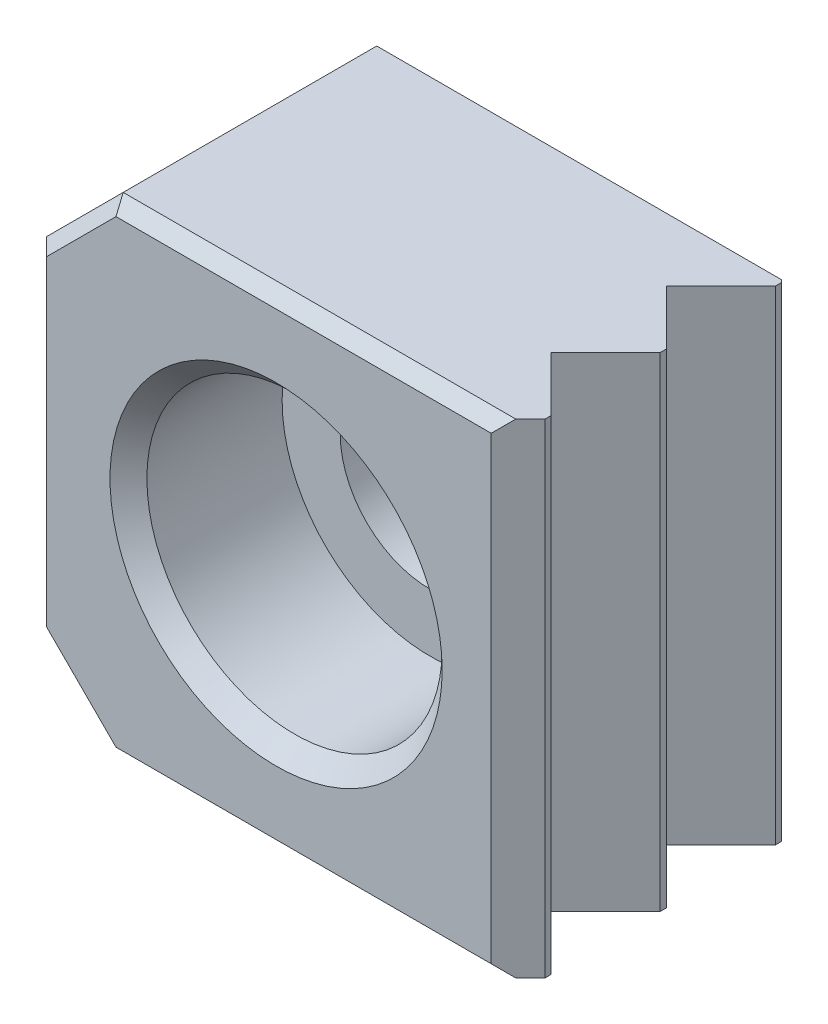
ISO-10303-21;
HEADER;
FILE_DESCRIPTION(('STEP AP214'),'2;1');
FILE_NAME('part.step','',(''),(''),'','','');
FILE_SCHEMA(('AUTOMOTIVE_DESIGN { 1 0 10303 214 1 1 1 1 }'));
ENDSEC;
DATA;
#1=APPLICATION_CONTEXT('core data for automotive mechanical design processes');
#2=APPLICATION_PROTOCOL_DEFINITION('international standard','automotive_design',2000,#1);
#3=PRODUCT_CONTEXT('',#1,'mechanical');
#4=PRODUCT('Part','Part','',(#3));
#5=PRODUCT_RELATED_PRODUCT_CATEGORY('part','',(#4));
#6=PRODUCT_DEFINITION_FORMATION('','',#4);
#7=PRODUCT_DEFINITION_CONTEXT('part definition',#1,'design');
#8=PRODUCT_DEFINITION('design','',#6,#7);
#9=PRODUCT_DEFINITION_SHAPE('','',#8);
#10=(LENGTH_UNIT() NAMED_UNIT(*) SI_UNIT(.MILLI.,.METRE.));
#11=(NAMED_UNIT(*) PLANE_ANGLE_UNIT() SI_UNIT($,.RADIAN.));
#12=(NAMED_UNIT(*) SI_UNIT($,.STERADIAN.) SOLID_ANGLE_UNIT());
#13=UNCERTAINTY_MEASURE_WITH_UNIT(LENGTH_MEASURE(1.E-05),#10,'distance_accuracy_value','');
#14=(GEOMETRIC_REPRESENTATION_CONTEXT(3) GLOBAL_UNCERTAINTY_ASSIGNED_CONTEXT((#13)) GLOBAL_UNIT_ASSIGNED_CONTEXT((#10,
#11,#12)) REPRESENTATION_CONTEXT('',''));
#15=CARTESIAN_POINT('',(0.,0.,0.));
#16=DIRECTION('',(0.,0.,1.));
#17=DIRECTION('',(1.,0.,0.));
#18=AXIS2_PLACEMENT_3D('',#15,#16,#17);
#19=CARTESIAN_POINT('',(5.,-5.,6.));
#20=DIRECTION('',(-1.,0.,0.));
#21=DIRECTION('',(0.,-1.,0.));
#22=AXIS2_PLACEMENT_3D('',#19,#20,#21);
#23=PLANE('',#22);
#24=DIRECTION('',(0.,1.,0.));
#25=VECTOR('',#24,1.);
#26=CARTESIAN_POINT('',(5.,-5.,3.0635000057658));
#27=LINE('',#26,#25);
#28=CARTESIAN_POINT('',(5.,-5.,3.0635000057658));
#29=VERTEX_POINT('',#28);
#30=CARTESIAN_POINT('',(5.,5.,3.0635000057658));
#31=VERTEX_POINT('',#30);
#32=EDGE_CURVE('E221',#29,#31,#27,.T.);
#33=ORIENTED_EDGE('',*,*,#32,.F.);
#34=DIRECTION('',(0.,0.,-1.));
#35=VECTOR('',#34,1.);
#36=CARTESIAN_POINT('',(5.,-5.,6.));
#37=LINE('',#36,#35);
#38=CARTESIAN_POINT('',(5.,-5.,2.9364999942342));
#39=VERTEX_POINT('',#38);
#40=EDGE_CURVE('E177',#29,#39,#37,.T.);
#41=ORIENTED_EDGE('',*,*,#40,.T.);
#42=DIRECTION('',(0.,1.,0.));
#43=VECTOR('',#42,1.);
#44=CARTESIAN_POINT('',(5.,-5.,2.9364999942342));
#45=LINE('',#44,#43);
#46=CARTESIAN_POINT('',(5.,5.,2.9364999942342));
#47=VERTEX_POINT('',#46);
#48=EDGE_CURVE('E214',#39,#47,#45,.T.);
#49=ORIENTED_EDGE('',*,*,#48,.T.);
#50=DIRECTION('',(0.,0.,-1.));
#51=VECTOR('',#50,1.);
#52=CARTESIAN_POINT('',(5.,5.,6.));
#53=LINE('',#52,#51);
#54=EDGE_CURVE('E236',#31,#47,#53,.T.);
#55=ORIENTED_EDGE('',*,*,#54,.F.);
#56=EDGE_LOOP('',(#33,#41,#49,#55));
#57=FACE_BOUND('',#56,.T.);
#58=ADVANCED_FACE('F14',(#57),#23,.F.);
#59=DIRECTION('',(0.,-1.,0.));
#60=VECTOR('',#59,1.);
#61=CARTESIAN_POINT('',(5.,-5.,5.3177500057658));
#62=LINE('',#61,#60);
#63=CARTESIAN_POINT('',(5.,5.,5.3177500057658));
#64=VERTEX_POINT('',#63);
#65=CARTESIAN_POINT('',(5.,-5.,5.3177500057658));
#66=VERTEX_POINT('',#65);
#67=EDGE_CURVE('E156',#64,#66,#62,.T.);
#68=ORIENTED_EDGE('',*,*,#67,.F.);
#69=CARTESIAN_POINT('',(5.,5.,5.4447500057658));
#70=VERTEX_POINT('',#69);
#71=EDGE_CURVE('E237',#70,#64,#53,.T.);
#72=ORIENTED_EDGE('',*,*,#71,.F.);
#73=DIRECTION('',(0.,1.,0.));
#74=VECTOR('',#73,1.);
#75=CARTESIAN_POINT('',(5.,-5.,5.4447500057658));
#76=LINE('',#75,#74);
#77=CARTESIAN_POINT('',(5.,-5.,5.4447500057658));
#78=VERTEX_POINT('',#77);
#79=EDGE_CURVE('E212',#78,#70,#76,.T.);
#80=ORIENTED_EDGE('',*,*,#79,.F.);
#81=EDGE_CURVE('E232',#78,#66,#37,.T.);
#82=ORIENTED_EDGE('',*,*,#81,.T.);
#83=EDGE_LOOP('',(#68,#72,#80,#82));
#84=FACE_BOUND('',#83,.T.);
#85=ADVANCED_FACE('F393',(#84),#23,.F.);
#86=CARTESIAN_POINT('',(5.,-5.,0.682249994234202));
#87=VERTEX_POINT('',#86);
#88=CARTESIAN_POINT('',(5.,-5.,0.555249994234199));
#89=VERTEX_POINT('',#88);
#90=EDGE_CURVE('E229',#87,#89,#37,.T.);
#91=ORIENTED_EDGE('',*,*,#90,.T.);
#92=DIRECTION('',(0.,1.,0.));
#93=VECTOR('',#92,1.);
#94=CARTESIAN_POINT('',(5.,-5.,0.555249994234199));
#95=LINE('',#94,#93);
#96=CARTESIAN_POINT('',(5.,5.,0.5552499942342));
#97=VERTEX_POINT('',#96);
#98=EDGE_CURVE('E169',#89,#97,#95,.T.);
#99=ORIENTED_EDGE('',*,*,#98,.T.);
#100=CARTESIAN_POINT('',(5.,5.,0.682249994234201));
#101=VERTEX_POINT('',#100);
#102=EDGE_CURVE('E233',#101,#97,#53,.T.);
#103=ORIENTED_EDGE('',*,*,#102,.F.);
#104=DIRECTION('',(0.,-1.,0.));
#105=VECTOR('',#104,1.);
#106=CARTESIAN_POINT('',(5.,-5.,0.682249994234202));
#107=LINE('',#106,#105);
#108=EDGE_CURVE('E217',#101,#87,#107,.T.);
#109=ORIENTED_EDGE('',*,*,#108,.T.);
#110=EDGE_LOOP('',(#91,#99,#103,#109));
#111=FACE_BOUND('',#110,.T.);
#112=ADVANCED_FACE('F368',(#111),#23,.F.);
#113=CARTESIAN_POINT('',(-5.,5.,6.));
#114=DIRECTION('',(0.,1.,0.));
#115=DIRECTION('',(-1.,0.,0.));
#116=AXIS2_PLACEMENT_3D('',#113,#114,#115);
#117=PLANE('',#116);
#118=DIRECTION('',(0.,0.,1.));
#119=VECTOR('',#118,1.);
#120=CARTESIAN_POINT('',(-3.4125,5.,6.));
#121=LINE('',#120,#119);
#122=CARTESIAN_POINT('',(-3.4125,5.,0.508));
#123=VERTEX_POINT('',#122);
#124=CARTESIAN_POINT('',(-3.4125,5.,5.746));
#125=VERTEX_POINT('',#124);
#126=EDGE_CURVE('E250',#123,#125,#121,.T.);
#127=ORIENTED_EDGE('',*,*,#126,.T.);
#128=DIRECTION('',(1.,0.,0.));
#129=VECTOR('',#128,1.);
#130=CARTESIAN_POINT('',(4.44475005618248,5.,5.746));
#131=LINE('',#130,#129);
#132=CARTESIAN_POINT('',(4.6987500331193,5.,5.746));
#133=VERTEX_POINT('',#132);
#134=EDGE_CURVE('E9',#125,#133,#131,.T.);
#135=ORIENTED_EDGE('',*,*,#134,.T.);
#136=DIRECTION('',(-0.707106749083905,0.,0.707106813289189));
#137=VECTOR('',#136,1.);
#138=CARTESIAN_POINT('',(5.0635,5.,5.38125));
#139=LINE('',#138,#137);
#140=EDGE_CURVE('E196',#70,#133,#139,.T.);
#141=ORIENTED_EDGE('',*,*,#140,.F.);
#142=ORIENTED_EDGE('',*,*,#71,.T.);
#143=DIRECTION('',(0.70710681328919,0.,0.707106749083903));
#144=VECTOR('',#143,1.);
#145=CARTESIAN_POINT('',(3.872875,5.,4.19062510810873));
#146=LINE('',#145,#144);
#147=CARTESIAN_POINT('',(3.872875,5.,4.19062510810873));
#148=VERTEX_POINT('',#147);
#149=EDGE_CURVE('E194',#148,#64,#146,.T.);
#150=ORIENTED_EDGE('',*,*,#149,.F.);
#151=DIRECTION('',(-0.707106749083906,0.,0.707106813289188));
#152=VECTOR('',#151,1.);
#153=CARTESIAN_POINT('',(5.0635,5.,3.));
#154=LINE('',#153,#152);
#155=EDGE_CURVE('E168',#31,#148,#154,.T.);
#156=ORIENTED_EDGE('',*,*,#155,.F.);
#157=ORIENTED_EDGE('',*,*,#54,.T.);
#158=DIRECTION('',(-0.707106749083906,0.,-0.707106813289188));
#159=VECTOR('',#158,1.);
#160=CARTESIAN_POINT('',(5.0635,5.,3.));
#161=LINE('',#160,#159);
#162=CARTESIAN_POINT('',(3.872875,5.,1.80937489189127));
#163=VERTEX_POINT('',#162);
#164=EDGE_CURVE('E205',#47,#163,#161,.T.);
#165=ORIENTED_EDGE('',*,*,#164,.T.);
#166=DIRECTION('',(0.707106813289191,0.,-0.707106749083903));
#167=VECTOR('',#166,1.);
#168=CARTESIAN_POINT('',(3.872875,5.,1.80937489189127));
#169=LINE('',#168,#167);
#170=EDGE_CURVE('E202',#163,#101,#169,.T.);
#171=ORIENTED_EDGE('',*,*,#170,.T.);
#172=ORIENTED_EDGE('',*,*,#102,.T.);
#173=DIRECTION('',(-0.707106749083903,0.,-0.70710681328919));
#174=VECTOR('',#173,1.);
#175=CARTESIAN_POINT('',(5.0635,5.,0.61875));
#176=LINE('',#175,#174);
#177=CARTESIAN_POINT('',(4.9527500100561,5.,0.508));
#178=VERTEX_POINT('',#177);
#179=EDGE_CURVE('E199',#97,#178,#176,.T.);
#180=ORIENTED_EDGE('',*,*,#179,.T.);
#181=DIRECTION('',(-1.,0.,0.));
#182=VECTOR('',#181,1.);
#183=CARTESIAN_POINT('',(-5.,5.,0.508));
#184=LINE('',#183,#182);
#185=EDGE_CURVE('E289',#178,#123,#184,.T.);
#186=ORIENTED_EDGE('',*,*,#185,.T.);
#187=EDGE_LOOP('',(#127,#135,#141,#142,#150,#156,#157,#165,#171,#172,#180,#186));
#188=FACE_BOUND('',#187,.T.);
#189=ADVANCED_FACE('F364',(#188),#117,.T.);
#190=CARTESIAN_POINT('',(5.,-5.,6.));
#191=DIRECTION('',(0.,-1.,0.));
#192=DIRECTION('',(1.,0.,0.));
#193=AXIS2_PLACEMENT_3D('',#190,#191,#192);
#194=PLANE('',#193);
#195=DIRECTION('',(-0.707106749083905,0.,0.707106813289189));
#196=VECTOR('',#195,1.);
#197=CARTESIAN_POINT('',(5.0635,-5.,5.38125));
#198=LINE('',#197,#196);
#199=CARTESIAN_POINT('',(4.6987500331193,-5.,5.746));
#200=VERTEX_POINT('',#199);
#201=EDGE_CURVE('E161',#78,#200,#198,.T.);
#202=ORIENTED_EDGE('',*,*,#201,.T.);
#203=DIRECTION('',(-1.,0.,0.));
#204=VECTOR('',#203,1.);
#205=CARTESIAN_POINT('',(-3.4125,-5.,5.746));
#206=LINE('',#205,#204);
#207=CARTESIAN_POINT('',(-3.4125,-5.,5.746));
#208=VERTEX_POINT('',#207);
#209=EDGE_CURVE('E291',#200,#208,#206,.T.);
#210=ORIENTED_EDGE('',*,*,#209,.T.);
#211=DIRECTION('',(0.,0.,-1.));
#212=VECTOR('',#211,1.);
#213=CARTESIAN_POINT('',(-3.4125,-5.,0.));
#214=LINE('',#213,#212);
#215=CARTESIAN_POINT('',(-3.4125,-5.,0.508));
#216=VERTEX_POINT('',#215);
#217=EDGE_CURVE('E244',#208,#216,#214,.T.);
#218=ORIENTED_EDGE('',*,*,#217,.T.);
#219=DIRECTION('',(1.,0.,0.));
#220=VECTOR('',#219,1.);
#221=CARTESIAN_POINT('',(5.,-5.,0.508));
#222=LINE('',#221,#220);
#223=CARTESIAN_POINT('',(4.9527500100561,-5.,0.508));
#224=VERTEX_POINT('',#223);
#225=EDGE_CURVE('E275',#216,#224,#222,.T.);
#226=ORIENTED_EDGE('',*,*,#225,.T.);
#227=DIRECTION('',(-0.707106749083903,0.,-0.70710681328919));
#228=VECTOR('',#227,1.);
#229=CARTESIAN_POINT('',(5.0635,-5.,0.61875));
#230=LINE('',#229,#228);
#231=EDGE_CURVE('E186',#89,#224,#230,.T.);
#232=ORIENTED_EDGE('',*,*,#231,.F.);
#233=ORIENTED_EDGE('',*,*,#90,.F.);
#234=DIRECTION('',(0.707106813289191,0.,-0.707106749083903));
#235=VECTOR('',#234,1.);
#236=CARTESIAN_POINT('',(3.872875,-5.,1.80937489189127));
#237=LINE('',#236,#235);
#238=CARTESIAN_POINT('',(3.872875,-5.,1.80937489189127));
#239=VERTEX_POINT('',#238);
#240=EDGE_CURVE('E189',#239,#87,#237,.T.);
#241=ORIENTED_EDGE('',*,*,#240,.F.);
#242=DIRECTION('',(-0.707106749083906,0.,-0.707106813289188));
#243=VECTOR('',#242,1.);
#244=CARTESIAN_POINT('',(5.0635,-5.,3.));
#245=LINE('',#244,#243);
#246=EDGE_CURVE('E191',#39,#239,#245,.T.);
#247=ORIENTED_EDGE('',*,*,#246,.F.);
#248=ORIENTED_EDGE('',*,*,#40,.F.);
#249=DIRECTION('',(-0.707106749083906,0.,0.707106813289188));
#250=VECTOR('',#249,1.);
#251=CARTESIAN_POINT('',(5.0635,-5.,3.));
#252=LINE('',#251,#250);
#253=CARTESIAN_POINT('',(3.872875,-5.,4.19062510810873));
#254=VERTEX_POINT('',#253);
#255=EDGE_CURVE('E162',#29,#254,#252,.T.);
#256=ORIENTED_EDGE('',*,*,#255,.T.);
#257=DIRECTION('',(0.70710681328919,0.,0.707106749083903));
#258=VECTOR('',#257,1.);
#259=CARTESIAN_POINT('',(3.872875,-5.,4.19062510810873));
#260=LINE('',#259,#258);
#261=EDGE_CURVE('E150',#254,#66,#260,.T.);
#262=ORIENTED_EDGE('',*,*,#261,.T.);
#263=ORIENTED_EDGE('',*,*,#81,.F.);
#264=EDGE_LOOP('',(#202,#210,#218,#226,#232,#233,#241,#247,#248,#256,#262,#263));
#265=FACE_BOUND('',#264,.T.);
#266=ADVANCED_FACE('F174',(#265),#194,.T.);
#267=CARTESIAN_POINT('',(5.,5.,6.));
#268=DIRECTION('',(0.,0.,-1.));
#269=DIRECTION('',(1.,0.,0.));
#270=AXIS2_PLACEMENT_3D('',#267,#268,#269);
#271=PLANE('',#270);
#272=CARTESIAN_POINT('',(0.,0.,6.));
#273=DIRECTION('',(0.,0.,-1.));
#274=DIRECTION('',(1.,0.,0.));
#275=AXIS2_PLACEMENT_3D('',#272,#273,#274);
#276=CIRCLE('',#275,3.431);
#277=CARTESIAN_POINT('',(3.431,0.,6.));
#278=VERTEX_POINT('',#277);
#279=EDGE_CURVE('E255',#278,#278,#276,.T.);
#280=ORIENTED_EDGE('',*,*,#279,.T.);
#281=EDGE_LOOP('',(#280));
#282=FACE_BOUND('',#281,.T.);
#283=DIRECTION('',(0.707106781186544,-0.707106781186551,0.));
#284=VECTOR('',#283,1.);
#285=CARTESIAN_POINT('',(-3.2328948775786,-4.82039487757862,6.));
#286=LINE('',#285,#284);
#287=CARTESIAN_POINT('',(-4.746,-3.30728975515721,6.));
#288=VERTEX_POINT('',#287);
#289=CARTESIAN_POINT('',(-3.30728975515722,-4.746,6.));
#290=VERTEX_POINT('',#289);
#291=EDGE_CURVE('E300',#288,#290,#286,.T.);
#292=ORIENTED_EDGE('',*,*,#291,.T.);
#293=DIRECTION('',(1.,0.,0.));
#294=VECTOR('',#293,1.);
#295=CARTESIAN_POINT('',(4.44475005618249,-4.746,6.));
#296=LINE('',#295,#294);
#297=CARTESIAN_POINT('',(4.44475005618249,-4.746,6.));
#298=VERTEX_POINT('',#297);
#299=EDGE_CURVE('E302',#290,#298,#296,.T.);
#300=ORIENTED_EDGE('',*,*,#299,.T.);
#301=DIRECTION('',(0.,-1.,0.));
#302=VECTOR('',#301,1.);
#303=CARTESIAN_POINT('',(4.44475005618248,5.,6.));
#304=LINE('',#303,#302);
#305=CARTESIAN_POINT('',(4.44475005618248,4.746,6.));
#306=VERTEX_POINT('',#305);
#307=EDGE_CURVE('E241',#306,#298,#304,.T.);
#308=ORIENTED_EDGE('',*,*,#307,.F.);
#309=DIRECTION('',(-1.,0.,0.));
#310=VECTOR('',#309,1.);
#311=CARTESIAN_POINT('',(-3.4125,4.746,6.));
#312=LINE('',#311,#310);
#313=CARTESIAN_POINT('',(-3.30728975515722,4.746,6.));
#314=VERTEX_POINT('',#313);
#315=EDGE_CURVE('E294',#306,#314,#312,.T.);
#316=ORIENTED_EDGE('',*,*,#315,.T.);
#317=DIRECTION('',(-0.707106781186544,-0.707106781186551,0.));
#318=VECTOR('',#317,1.);
#319=CARTESIAN_POINT('',(-4.82039487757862,3.23289487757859,6.));
#320=LINE('',#319,#318);
#321=CARTESIAN_POINT('',(-4.746,3.30728975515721,6.));
#322=VERTEX_POINT('',#321);
#323=EDGE_CURVE('E296',#314,#322,#320,.T.);
#324=ORIENTED_EDGE('',*,*,#323,.T.);
#325=DIRECTION('',(0.,-1.,0.));
#326=VECTOR('',#325,1.);
#327=CARTESIAN_POINT('',(-4.746,5.,6.));
#328=LINE('',#327,#326);
#329=EDGE_CURVE('E298',#322,#288,#328,.T.);
#330=ORIENTED_EDGE('',*,*,#329,.T.);
#331=EDGE_LOOP('',(#292,#300,#308,#316,#324,#330));
#332=FACE_BOUND('',#331,.T.);
#333=ADVANCED_FACE('F406',(#282,#332),#271,.F.);
#334=CARTESIAN_POINT('',(-5.,5.,6.));
#335=DIRECTION('',(1.,0.,0.));
#336=DIRECTION('',(0.,1.,0.));
#337=AXIS2_PLACEMENT_3D('',#334,#335,#336);
#338=PLANE('',#337);
#339=DIRECTION('',(0.,0.,1.));
#340=VECTOR('',#339,1.);
#341=CARTESIAN_POINT('',(-5.,-3.4125,6.));
#342=LINE('',#341,#340);
#343=CARTESIAN_POINT('',(-5.,-3.4125,0.508));
#344=VERTEX_POINT('',#343);
#345=CARTESIAN_POINT('',(-5.,-3.4125,5.746));
#346=VERTEX_POINT('',#345);
#347=EDGE_CURVE('E248',#344,#346,#342,.T.);
#348=ORIENTED_EDGE('',*,*,#347,.T.);
#349=DIRECTION('',(0.,1.,0.));
#350=VECTOR('',#349,1.);
#351=CARTESIAN_POINT('',(-5.,5.,5.746));
#352=LINE('',#351,#350);
#353=CARTESIAN_POINT('',(-5.,3.4125,5.746));
#354=VERTEX_POINT('',#353);
#355=EDGE_CURVE('E35',#346,#354,#352,.T.);
#356=ORIENTED_EDGE('',*,*,#355,.T.);
#357=DIRECTION('',(0.,0.,-1.));
#358=VECTOR('',#357,1.);
#359=CARTESIAN_POINT('',(-5.,3.4125,0.));
#360=LINE('',#359,#358);
#361=CARTESIAN_POINT('',(-5.,3.4125,0.508));
#362=VERTEX_POINT('',#361);
#363=EDGE_CURVE('E246',#354,#362,#360,.T.);
#364=ORIENTED_EDGE('',*,*,#363,.T.);
#365=DIRECTION('',(0.,-1.,0.));
#366=VECTOR('',#365,1.);
#367=CARTESIAN_POINT('',(-5.,-3.4125,0.508));
#368=LINE('',#367,#366);
#369=EDGE_CURVE('E284',#362,#344,#368,.T.);
#370=ORIENTED_EDGE('',*,*,#369,.T.);
#371=EDGE_LOOP('',(#348,#356,#364,#370));
#372=FACE_BOUND('',#371,.T.);
#373=ADVANCED_FACE('F319',(#372),#338,.F.);
#374=CARTESIAN_POINT('',(5.,5.,0.));
#375=DIRECTION('',(0.,0.,-1.));
#376=DIRECTION('',(1.,0.,0.));
#377=AXIS2_PLACEMENT_3D('',#374,#375,#376);
#378=PLANE('',#377);
#379=CARTESIAN_POINT('',(0.,0.,0.));
#380=DIRECTION('',(0.,0.,-1.));
#381=DIRECTION('',(1.,0.,0.));
#382=AXIS2_PLACEMENT_3D('',#379,#380,#381);
#383=CIRCLE('',#382,2.231);
#384=CARTESIAN_POINT('',(2.231,0.,0.));
#385=VERTEX_POINT('',#384);
#386=EDGE_CURVE('E258',#385,#385,#383,.F.);
#387=ORIENTED_EDGE('',*,*,#386,.T.);
#388=EDGE_LOOP('',(#387));
#389=FACE_BOUND('',#388,.T.);
#390=DIRECTION('',(0.,1.,0.));
#391=VECTOR('',#390,1.);
#392=CARTESIAN_POINT('',(4.44475005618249,5.,0.));
#393=LINE('',#392,#391);
#394=CARTESIAN_POINT('',(4.44475005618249,-4.492,0.));
#395=VERTEX_POINT('',#394);
#396=CARTESIAN_POINT('',(4.44475005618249,4.492,0.));
#397=VERTEX_POINT('',#396);
#398=EDGE_CURVE('E238',#395,#397,#393,.T.);
#399=ORIENTED_EDGE('',*,*,#398,.F.);
#400=DIRECTION('',(-1.,0.,0.));
#401=VECTOR('',#400,1.);
#402=CARTESIAN_POINT('',(5.,-4.492,0.));
#403=LINE('',#402,#401);
#404=CARTESIAN_POINT('',(-3.20207951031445,-4.492,0.));
#405=VERTEX_POINT('',#404);
#406=EDGE_CURVE('E272',#395,#405,#403,.T.);
#407=ORIENTED_EDGE('',*,*,#406,.T.);
#408=DIRECTION('',(-0.707106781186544,0.707106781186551,0.));
#409=VECTOR('',#408,1.);
#410=CARTESIAN_POINT('',(-3.84703975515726,-3.84703975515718,0.));
#411=LINE('',#410,#409);
#412=CARTESIAN_POINT('',(-4.492,-3.20207951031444,0.));
#413=VERTEX_POINT('',#412);
#414=EDGE_CURVE('E270',#405,#413,#411,.T.);
#415=ORIENTED_EDGE('',*,*,#414,.T.);
#416=DIRECTION('',(0.,1.,0.));
#417=VECTOR('',#416,1.);
#418=CARTESIAN_POINT('',(-4.492,3.4125,0.));
#419=LINE('',#418,#417);
#420=CARTESIAN_POINT('',(-4.492,3.20207951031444,0.));
#421=VERTEX_POINT('',#420);
#422=EDGE_CURVE('E268',#413,#421,#419,.T.);
#423=ORIENTED_EDGE('',*,*,#422,.T.);
#424=DIRECTION('',(0.707106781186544,0.707106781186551,0.));
#425=VECTOR('',#424,1.);
#426=CARTESIAN_POINT('',(1.15296024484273,8.84703975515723,0.));
#427=LINE('',#426,#425);
#428=CARTESIAN_POINT('',(-3.20207951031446,4.492,0.));
#429=VERTEX_POINT('',#428);
#430=EDGE_CURVE('E266',#421,#429,#427,.T.);
#431=ORIENTED_EDGE('',*,*,#430,.T.);
#432=DIRECTION('',(1.,0.,0.));
#433=VECTOR('',#432,1.);
#434=CARTESIAN_POINT('',(5.,4.492,0.));
#435=LINE('',#434,#433);
#436=EDGE_CURVE('E264',#429,#397,#435,.T.);
#437=ORIENTED_EDGE('',*,*,#436,.T.);
#438=EDGE_LOOP('',(#399,#407,#415,#423,#431,#437));
#439=FACE_BOUND('',#438,.T.);
#440=ADVANCED_FACE('F356',(#389,#439),#378,.T.);
#441=CARTESIAN_POINT('',(0.,0.,2.825));
#442=DIRECTION('',(0.,0.,1.));
#443=DIRECTION('',(-1.,0.,0.));
#444=AXIS2_PLACEMENT_3D('',#441,#442,#443);
#445=CYLINDRICAL_SURFACE('',#444,3.05);
#446=CARTESIAN_POINT('',(0.,0.,5.619));
#447=DIRECTION('',(0.,0.,-1.));
#448=DIRECTION('',(1.,0.,0.));
#449=AXIS2_PLACEMENT_3D('',#446,#447,#448);
#450=CIRCLE('',#449,3.05);
#451=CARTESIAN_POINT('',(3.05,0.,5.619));
#452=VERTEX_POINT('',#451);
#453=EDGE_CURVE('E252',#452,#452,#450,.F.);
#454=ORIENTED_EDGE('',*,*,#453,.T.);
#455=EDGE_LOOP('',(#454));
#456=FACE_BOUND('',#455,.T.);
#457=CARTESIAN_POINT('',(0.,0.,2.825));
#458=DIRECTION('',(0.,0.,1.));
#459=DIRECTION('',(-1.,0.,0.));
#460=AXIS2_PLACEMENT_3D('',#457,#458,#459);
#461=CIRCLE('',#460,3.05);
#462=CARTESIAN_POINT('',(-3.05,0.,2.825));
#463=VERTEX_POINT('',#462);
#464=EDGE_CURVE('E226',#463,#463,#461,.T.);
#465=ORIENTED_EDGE('',*,*,#464,.F.);
#466=EDGE_LOOP('',(#465));
#467=FACE_BOUND('',#466,.T.);
#468=ADVANCED_FACE('F416',(#456,#467),#445,.F.);
#469=CARTESIAN_POINT('',(0.,0.,2.825));
#470=DIRECTION('',(0.,0.,1.));
#471=DIRECTION('',(-1.,0.,0.));
#472=AXIS2_PLACEMENT_3D('',#469,#470,#471);
#473=PLANE('',#472);
#474=CARTESIAN_POINT('',(0.,0.,2.825));
#475=DIRECTION('',(0.,0.,1.));
#476=DIRECTION('',(-1.,0.,0.));
#477=AXIS2_PLACEMENT_3D('',#474,#475,#476);
#478=CIRCLE('',#477,1.85);
#479=CARTESIAN_POINT('',(-1.85,0.,2.825));
#480=VERTEX_POINT('',#479);
#481=EDGE_CURVE('E223',#480,#480,#478,.T.);
#482=ORIENTED_EDGE('',*,*,#481,.F.);
#483=EDGE_LOOP('',(#482));
#484=FACE_BOUND('',#483,.T.);
#485=ORIENTED_EDGE('',*,*,#464,.T.);
#486=EDGE_LOOP('',(#485));
#487=FACE_BOUND('',#486,.T.);
#488=ADVANCED_FACE('F420',(#484,#487),#473,.T.);
#489=CARTESIAN_POINT('',(0.,0.,0.));
#490=DIRECTION('',(0.,0.,1.));
#491=DIRECTION('',(-1.,0.,0.));
#492=AXIS2_PLACEMENT_3D('',#489,#490,#491);
#493=CYLINDRICAL_SURFACE('',#492,1.85);
#494=CARTESIAN_POINT('',(0.,0.,0.381));
#495=DIRECTION('',(0.,0.,-1.));
#496=DIRECTION('',(1.,0.,0.));
#497=AXIS2_PLACEMENT_3D('',#494,#495,#496);
#498=CIRCLE('',#497,1.85);
#499=CARTESIAN_POINT('',(1.85,0.,0.381));
#500=VERTEX_POINT('',#499);
#501=EDGE_CURVE('E261',#500,#500,#498,.T.);
#502=ORIENTED_EDGE('',*,*,#501,.T.);
#503=EDGE_LOOP('',(#502));
#504=FACE_BOUND('',#503,.T.);
#505=ORIENTED_EDGE('',*,*,#481,.T.);
#506=EDGE_LOOP('',(#505));
#507=FACE_BOUND('',#506,.T.);
#508=ADVANCED_FACE('F424',(#504,#507),#493,.F.);
#509=CARTESIAN_POINT('',(5.0635,5.,0.61875));
#510=DIRECTION('',(-0.707106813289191,0.,0.707106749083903));
#511=DIRECTION('',(-0.707106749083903,0.,-0.707106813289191));
#512=AXIS2_PLACEMENT_3D('',#509,#510,#511);
#513=PLANE('',#512);
#514=ORIENTED_EDGE('',*,*,#231,.T.);
#515=DIRECTION('',(0.577350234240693,-0.577350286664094,0.577350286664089));
#516=VECTOR('',#515,1.);
#517=CARTESIAN_POINT('',(4.62983334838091,-4.67708330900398,0.185083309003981));
#518=LINE('',#517,#516);
#519=EDGE_CURVE('E279',#224,#395,#518,.F.);
#520=ORIENTED_EDGE('',*,*,#519,.T.);
#521=ORIENTED_EDGE('',*,*,#398,.T.);
#522=DIRECTION('',(-0.577350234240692,-0.577350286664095,-0.577350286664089));
#523=VECTOR('',#522,1.);
#524=CARTESIAN_POINT('',(4.62983334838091,4.67708330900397,0.185083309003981));
#525=LINE('',#524,#523);
#526=EDGE_CURVE('E277',#397,#178,#525,.F.);
#527=ORIENTED_EDGE('',*,*,#526,.T.);
#528=ORIENTED_EDGE('',*,*,#179,.F.);
#529=ORIENTED_EDGE('',*,*,#98,.F.);
#530=EDGE_LOOP('',(#514,#520,#521,#527,#528,#529));
#531=FACE_BOUND('',#530,.T.);
#532=ADVANCED_FACE('F362',(#531),#513,.F.);
#533=CARTESIAN_POINT('',(5.0635,5.,5.38125));
#534=DIRECTION('',(0.707106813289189,0.,0.707106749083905));
#535=DIRECTION('',(-0.707106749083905,0.,0.707106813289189));
#536=AXIS2_PLACEMENT_3D('',#533,#534,#535);
#537=PLANE('',#536);
#538=ORIENTED_EDGE('',*,*,#307,.T.);
#539=DIRECTION('',(0.577350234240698,-0.577350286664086,-0.577350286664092));
#540=VECTOR('',#539,1.);
#541=CARTESIAN_POINT('',(1.60858343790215,-1.9098331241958,8.83616687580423));
#542=LINE('',#541,#540);
#543=EDGE_CURVE('E306',#298,#200,#542,.T.);
#544=ORIENTED_EDGE('',*,*,#543,.T.);
#545=ORIENTED_EDGE('',*,*,#201,.F.);
#546=ORIENTED_EDGE('',*,*,#79,.T.);
#547=ORIENTED_EDGE('',*,*,#140,.T.);
#548=DIRECTION('',(-0.577350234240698,-0.577350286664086,0.577350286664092));
#549=VECTOR('',#548,1.);
#550=CARTESIAN_POINT('',(4.94191667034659,5.24316665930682,5.50283334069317));
#551=LINE('',#550,#549);
#552=EDGE_CURVE('E304',#133,#306,#551,.T.);
#553=ORIENTED_EDGE('',*,*,#552,.T.);
#554=EDGE_LOOP('',(#538,#544,#545,#546,#547,#553));
#555=FACE_BOUND('',#554,.T.);
#556=ADVANCED_FACE('F434',(#555),#537,.T.);
#557=CARTESIAN_POINT('',(5.0635,5.,3.));
#558=DIRECTION('',(-0.707106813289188,0.,0.707106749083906));
#559=DIRECTION('',(-0.707106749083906,0.,-0.707106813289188));
#560=AXIS2_PLACEMENT_3D('',#557,#558,#559);
#561=PLANE('',#560);
#562=ORIENTED_EDGE('',*,*,#246,.T.);
#563=DIRECTION('',(0.,-1.,0.));
#564=VECTOR('',#563,1.);
#565=CARTESIAN_POINT('',(3.872875,5.,1.80937489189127));
#566=LINE('',#565,#564);
#567=EDGE_CURVE('E170',#163,#239,#566,.T.);
#568=ORIENTED_EDGE('',*,*,#567,.F.);
#569=ORIENTED_EDGE('',*,*,#164,.F.);
#570=ORIENTED_EDGE('',*,*,#48,.F.);
#571=EDGE_LOOP('',(#562,#568,#569,#570));
#572=FACE_BOUND('',#571,.T.);
#573=ADVANCED_FACE('F437',(#572),#561,.F.);
#574=CARTESIAN_POINT('',(3.872875,5.,1.80937489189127));
#575=DIRECTION('',(-0.707106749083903,0.,-0.707106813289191));
#576=DIRECTION('',(0.707106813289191,0.,-0.707106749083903));
#577=AXIS2_PLACEMENT_3D('',#574,#575,#576);
#578=PLANE('',#577);
#579=ORIENTED_EDGE('',*,*,#170,.F.);
#580=ORIENTED_EDGE('',*,*,#567,.T.);
#581=ORIENTED_EDGE('',*,*,#240,.T.);
#582=ORIENTED_EDGE('',*,*,#108,.F.);
#583=EDGE_LOOP('',(#579,#580,#581,#582));
#584=FACE_BOUND('',#583,.T.);
#585=ADVANCED_FACE('F431',(#584),#578,.F.);
#586=CARTESIAN_POINT('',(5.0635,5.,3.));
#587=DIRECTION('',(0.707106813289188,0.,0.707106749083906));
#588=DIRECTION('',(-0.707106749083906,0.,0.707106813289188));
#589=AXIS2_PLACEMENT_3D('',#586,#587,#588);
#590=PLANE('',#589);
#591=ORIENTED_EDGE('',*,*,#32,.T.);
#592=ORIENTED_EDGE('',*,*,#155,.T.);
#593=DIRECTION('',(0.,-1.,0.));
#594=VECTOR('',#593,1.);
#595=CARTESIAN_POINT('',(3.872875,5.,4.19062510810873));
#596=LINE('',#595,#594);
#597=EDGE_CURVE('E153',#148,#254,#596,.T.);
#598=ORIENTED_EDGE('',*,*,#597,.T.);
#599=ORIENTED_EDGE('',*,*,#255,.F.);
#600=EDGE_LOOP('',(#591,#592,#598,#599));
#601=FACE_BOUND('',#600,.T.);
#602=ADVANCED_FACE('F165',(#601),#590,.T.);
#603=CARTESIAN_POINT('',(3.872875,5.,4.19062510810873));
#604=DIRECTION('',(0.707106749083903,0.,-0.70710681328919));
#605=DIRECTION('',(0.70710681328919,0.,0.707106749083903));
#606=AXIS2_PLACEMENT_3D('',#603,#604,#605);
#607=PLANE('',#606);
#608=ORIENTED_EDGE('',*,*,#67,.T.);
#609=ORIENTED_EDGE('',*,*,#261,.F.);
#610=ORIENTED_EDGE('',*,*,#597,.F.);
#611=ORIENTED_EDGE('',*,*,#149,.T.);
#612=EDGE_LOOP('',(#608,#609,#610,#611));
#613=FACE_BOUND('',#612,.T.);
#614=ADVANCED_FACE('F152',(#613),#607,.T.);
#615=CARTESIAN_POINT('',(-3.4125,-5.,6.));
#616=DIRECTION('',(-0.707106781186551,-0.707106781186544,0.));
#617=DIRECTION('',(0.707106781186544,-0.707106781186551,0.));
#618=AXIS2_PLACEMENT_3D('',#615,#616,#617);
#619=PLANE('',#618);
#620=ORIENTED_EDGE('',*,*,#217,.F.);
#621=DIRECTION('',(-0.707106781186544,0.707106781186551,0.));
#622=VECTOR('',#621,1.);
#623=CARTESIAN_POINT('',(-5.,-3.4125,5.746));
#624=LINE('',#623,#622);
#625=EDGE_CURVE('E308',#208,#346,#624,.T.);
#626=ORIENTED_EDGE('',*,*,#625,.T.);
#627=ORIENTED_EDGE('',*,*,#347,.F.);
#628=DIRECTION('',(0.707106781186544,-0.707106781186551,0.));
#629=VECTOR('',#628,1.);
#630=CARTESIAN_POINT('',(-3.4125,-5.,0.508));
#631=LINE('',#630,#629);
#632=EDGE_CURVE('E281',#344,#216,#631,.T.);
#633=ORIENTED_EDGE('',*,*,#632,.T.);
#634=EDGE_LOOP('',(#620,#626,#627,#633));
#635=FACE_BOUND('',#634,.T.);
#636=ADVANCED_FACE('F314',(#635),#619,.T.);
#637=CARTESIAN_POINT('',(-5.,3.4125,6.));
#638=DIRECTION('',(-0.707106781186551,0.707106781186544,0.));
#639=DIRECTION('',(-0.707106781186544,-0.707106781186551,0.));
#640=AXIS2_PLACEMENT_3D('',#637,#638,#639);
#641=PLANE('',#640);
#642=ORIENTED_EDGE('',*,*,#363,.F.);
#643=DIRECTION('',(0.707106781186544,0.707106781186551,0.));
#644=VECTOR('',#643,1.);
#645=CARTESIAN_POINT('',(-3.4125,5.,5.746));
#646=LINE('',#645,#644);
#647=EDGE_CURVE('E21',#354,#125,#646,.T.);
#648=ORIENTED_EDGE('',*,*,#647,.T.);
#649=ORIENTED_EDGE('',*,*,#126,.F.);
#650=DIRECTION('',(-0.707106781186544,-0.707106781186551,0.));
#651=VECTOR('',#650,1.);
#652=CARTESIAN_POINT('',(-5.,3.4125,0.508));
#653=LINE('',#652,#651);
#654=EDGE_CURVE('E286',#123,#362,#653,.T.);
#655=ORIENTED_EDGE('',*,*,#654,.T.);
#656=EDGE_LOOP('',(#642,#648,#649,#655));
#657=FACE_BOUND('',#656,.T.);
#658=ADVANCED_FACE('F449',(#657),#641,.T.);
#659=CARTESIAN_POINT('',(0.,0.,5.619));
#660=DIRECTION('',(0.,0.,1.));
#661=DIRECTION('',(-1.,0.,0.));
#662=AXIS2_PLACEMENT_3D('',#659,#660,#661);
#663=CONICAL_SURFACE('',#662,3.05,0.785398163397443);
#664=ORIENTED_EDGE('',*,*,#279,.F.);
#665=EDGE_LOOP('',(#664));
#666=FACE_BOUND('',#665,.T.);
#667=ORIENTED_EDGE('',*,*,#453,.F.);
#668=EDGE_LOOP('',(#667));
#669=FACE_BOUND('',#668,.T.);
#670=ADVANCED_FACE('F452',(#666,#669),#663,.F.);
#671=CARTESIAN_POINT('',(0.,0.,0.));
#672=DIRECTION('',(0.,0.,-1.));
#673=DIRECTION('',(1.,0.,0.));
#674=AXIS2_PLACEMENT_3D('',#671,#672,#673);
#675=CONICAL_SURFACE('',#674,2.231,0.785398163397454);
#676=ORIENTED_EDGE('',*,*,#501,.F.);
#677=EDGE_LOOP('',(#676));
#678=FACE_BOUND('',#677,.T.);
#679=ORIENTED_EDGE('',*,*,#386,.F.);
#680=EDGE_LOOP('',(#679));
#681=FACE_BOUND('',#680,.T.);
#682=ADVANCED_FACE('F455',(#678,#681),#675,.F.);
#683=CARTESIAN_POINT('',(5.,4.492,0.));
#684=DIRECTION('',(0.,-0.707106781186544,0.707106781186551));
#685=DIRECTION('',(0.,-0.707106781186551,-0.707106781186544));
#686=AXIS2_PLACEMENT_3D('',#683,#684,#685);
#687=PLANE('',#686);
#688=ORIENTED_EDGE('',*,*,#526,.F.);
#689=ORIENTED_EDGE('',*,*,#436,.F.);
#690=DIRECTION('',(-0.281084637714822,0.67859834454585,0.678598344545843));
#691=VECTOR('',#690,1.);
#692=CARTESIAN_POINT('',(-2.55404490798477,2.92750607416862,-1.56449392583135));
#693=LINE('',#692,#691);
#694=EDGE_CURVE('E178',#123,#429,#693,.F.);
#695=ORIENTED_EDGE('',*,*,#694,.F.);
#696=ORIENTED_EDGE('',*,*,#185,.F.);
#697=EDGE_LOOP('',(#688,#689,#695,#696));
#698=FACE_BOUND('',#697,.T.);
#699=ADVANCED_FACE('F359',(#698),#687,.F.);
#700=CARTESIAN_POINT('',(1.15296024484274,8.84703975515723,0.));
#701=DIRECTION('',(0.5,-0.5,0.707106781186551));
#702=DIRECTION('',(-0.816496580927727,0.,0.577350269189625));
#703=AXIS2_PLACEMENT_3D('',#700,#701,#702);
#704=PLANE('',#703);
#705=ORIENTED_EDGE('',*,*,#694,.T.);
#706=ORIENTED_EDGE('',*,*,#430,.F.);
#707=DIRECTION('',(0.678598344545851,-0.281084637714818,-0.678598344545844));
#708=VECTOR('',#707,1.);
#709=CARTESIAN_POINT('',(-2.96925987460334,2.57133989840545,-1.52274012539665));
#710=LINE('',#709,#708);
#711=EDGE_CURVE('E181',#362,#421,#710,.T.);
#712=ORIENTED_EDGE('',*,*,#711,.F.);
#713=ORIENTED_EDGE('',*,*,#654,.F.);
#714=EDGE_LOOP('',(#705,#706,#712,#713));
#715=FACE_BOUND('',#714,.T.);
#716=ADVANCED_FACE('F351',(#715),#704,.F.);
#717=CARTESIAN_POINT('',(-5.,5.,0.508));
#718=DIRECTION('',(-0.707106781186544,0.,-0.707106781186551));
#719=DIRECTION('',(0.707106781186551,0.,-0.707106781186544));
#720=AXIS2_PLACEMENT_3D('',#717,#718,#719);
#721=PLANE('',#720);
#722=ORIENTED_EDGE('',*,*,#711,.T.);
#723=ORIENTED_EDGE('',*,*,#422,.F.);
#724=DIRECTION('',(0.678598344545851,0.281084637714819,-0.678598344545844));
#725=VECTOR('',#724,1.);
#726=CARTESIAN_POINT('',(-3.39536971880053,-2.74784037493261,-1.09663028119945));
#727=LINE('',#726,#725);
#728=EDGE_CURVE('E341',#344,#413,#727,.T.);
#729=ORIENTED_EDGE('',*,*,#728,.F.);
#730=ORIENTED_EDGE('',*,*,#369,.F.);
#731=EDGE_LOOP('',(#722,#723,#729,#730));
#732=FACE_BOUND('',#731,.T.);
#733=ADVANCED_FACE('F347',(#732),#721,.T.);
#734=CARTESIAN_POINT('',(-3.84703975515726,-3.84703975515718,0.));
#735=DIRECTION('',(0.5,0.5,0.707106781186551));
#736=DIRECTION('',(-0.816496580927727,0.,0.577350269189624));
#737=AXIS2_PLACEMENT_3D('',#734,#735,#736);
#738=PLANE('',#737);
#739=ORIENTED_EDGE('',*,*,#728,.T.);
#740=ORIENTED_EDGE('',*,*,#414,.F.);
#741=DIRECTION('',(-0.281084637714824,-0.678598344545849,0.678598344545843));
#742=VECTOR('',#741,1.);
#743=CARTESIAN_POINT('',(-3.13001487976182,-4.31802059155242,-0.173979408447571));
#744=LINE('',#743,#742);
#745=EDGE_CURVE('E339',#216,#405,#744,.F.);
#746=ORIENTED_EDGE('',*,*,#745,.F.);
#747=ORIENTED_EDGE('',*,*,#632,.F.);
#748=EDGE_LOOP('',(#739,#740,#746,#747));
#749=FACE_BOUND('',#748,.T.);
#750=ADVANCED_FACE('F381',(#749),#738,.F.);
#751=CARTESIAN_POINT('',(5.,-4.492,0.));
#752=DIRECTION('',(0.,0.707106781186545,0.707106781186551));
#753=DIRECTION('',(0.,-0.707106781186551,0.707106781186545));
#754=AXIS2_PLACEMENT_3D('',#751,#752,#753);
#755=PLANE('',#754);
#756=ORIENTED_EDGE('',*,*,#519,.F.);
#757=ORIENTED_EDGE('',*,*,#225,.F.);
#758=ORIENTED_EDGE('',*,*,#745,.T.);
#759=ORIENTED_EDGE('',*,*,#406,.F.);
#760=EDGE_LOOP('',(#756,#757,#758,#759));
#761=FACE_BOUND('',#760,.T.);
#762=ADVANCED_FACE('F376',(#761),#755,.F.);
#763=CARTESIAN_POINT('',(-5.,5.,5.746));
#764=DIRECTION('',(0.,0.707106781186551,0.707106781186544));
#765=DIRECTION('',(0.,-0.707106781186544,0.707106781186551));
#766=AXIS2_PLACEMENT_3D('',#763,#764,#765);
#767=PLANE('',#766);
#768=ORIENTED_EDGE('',*,*,#552,.F.);
#769=ORIENTED_EDGE('',*,*,#134,.F.);
#770=DIRECTION('',(0.281084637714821,-0.678598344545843,0.67859834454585));
#771=VECTOR('',#770,1.);
#772=CARTESIAN_POINT('',(-3.53792611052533,5.30280541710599,5.443194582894));
#773=LINE('',#772,#771);
#774=EDGE_CURVE('E333',#314,#125,#773,.F.);
#775=ORIENTED_EDGE('',*,*,#774,.F.);
#776=ORIENTED_EDGE('',*,*,#315,.F.);
#777=EDGE_LOOP('',(#768,#769,#775,#776));
#778=FACE_BOUND('',#777,.T.);
#779=ADVANCED_FACE('F389',(#778),#767,.T.);
#780=CARTESIAN_POINT('',(0.973355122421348,9.02664487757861,6.));
#781=DIRECTION('',(-0.5,0.5,0.707106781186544));
#782=DIRECTION('',(-0.816496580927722,0.,-0.577350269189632));
#783=AXIS2_PLACEMENT_3D('',#780,#781,#782);
#784=PLANE('',#783);
#785=ORIENTED_EDGE('',*,*,#774,.T.);
#786=ORIENTED_EDGE('',*,*,#647,.F.);
#787=DIRECTION('',(-0.678598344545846,0.281084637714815,-0.678598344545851));
#788=VECTOR('',#787,1.);
#789=CARTESIAN_POINT('',(-3.2031916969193,2.66823763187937,7.54280830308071));
#790=LINE('',#789,#788);
#791=EDGE_CURVE('E329',#322,#354,#790,.T.);
#792=ORIENTED_EDGE('',*,*,#791,.F.);
#793=ORIENTED_EDGE('',*,*,#323,.F.);
#794=EDGE_LOOP('',(#785,#786,#792,#793));
#795=FACE_BOUND('',#794,.T.);
#796=ADVANCED_FACE('F498',(#795),#784,.T.);
#797=CARTESIAN_POINT('',(-4.746,5.,6.));
#798=DIRECTION('',(0.70710678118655,0.,-0.707106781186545));
#799=DIRECTION('',(0.707106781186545,0.,0.70710678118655));
#800=AXIS2_PLACEMENT_3D('',#797,#798,#799);
#801=PLANE('',#800);
#802=ORIENTED_EDGE('',*,*,#791,.T.);
#803=ORIENTED_EDGE('',*,*,#355,.F.);
#804=DIRECTION('',(-0.678598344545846,-0.281084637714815,-0.678598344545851));
#805=VECTOR('',#804,1.);
#806=CARTESIAN_POINT('',(-3.16143789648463,-2.65094264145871,7.58456210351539));
#807=LINE('',#806,#805);
#808=EDGE_CURVE('E326',#288,#346,#807,.T.);
#809=ORIENTED_EDGE('',*,*,#808,.F.);
#810=ORIENTED_EDGE('',*,*,#329,.F.);
#811=EDGE_LOOP('',(#802,#803,#809,#810));
#812=FACE_BOUND('',#811,.T.);
#813=ADVANCED_FACE('F324',(#812),#801,.F.);
#814=CARTESIAN_POINT('',(-4.02664487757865,-4.02664487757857,6.));
#815=DIRECTION('',(-0.5,-0.5,0.707106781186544));
#816=DIRECTION('',(-0.816496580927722,0.,-0.577350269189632));
#817=AXIS2_PLACEMENT_3D('',#814,#815,#816);
#818=PLANE('',#817);
#819=ORIENTED_EDGE('',*,*,#808,.T.);
#820=ORIENTED_EDGE('',*,*,#625,.F.);
#821=DIRECTION('',(0.281084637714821,0.678598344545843,0.67859834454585));
#822=VECTOR('',#821,1.);
#823=CARTESIAN_POINT('',(-3.22691261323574,-4.55195241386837,6.19404758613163));
#824=LINE('',#823,#822);
#825=EDGE_CURVE('E331',#290,#208,#824,.F.);
#826=ORIENTED_EDGE('',*,*,#825,.F.);
#827=ORIENTED_EDGE('',*,*,#291,.F.);
#828=EDGE_LOOP('',(#819,#820,#826,#827));
#829=FACE_BOUND('',#828,.T.);
#830=ADVANCED_FACE('F330',(#829),#818,.T.);
#831=CARTESIAN_POINT('',(5.,-5.,5.746));
#832=DIRECTION('',(0.,-0.707106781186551,0.707106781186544));
#833=DIRECTION('',(0.,-0.707106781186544,-0.707106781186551));
#834=AXIS2_PLACEMENT_3D('',#831,#832,#833);
#835=PLANE('',#834);
#836=ORIENTED_EDGE('',*,*,#543,.F.);
#837=ORIENTED_EDGE('',*,*,#299,.F.);
#838=ORIENTED_EDGE('',*,*,#825,.T.);
#839=ORIENTED_EDGE('',*,*,#209,.F.);
#840=EDGE_LOOP('',(#836,#837,#838,#839));
#841=FACE_BOUND('',#840,.T.);
#842=ADVANCED_FACE('F525',(#841),#835,.T.);
#843=CLOSED_SHELL('',(#58,#85,#112,#189,#266,#333,#373,#440,#468,#488,#508,#532,#556,#573,#585,
#602,#614,#636,#658,#670,#682,#699,#716,#733,#750,#762,#779,#796,#813,#830,#842));
#844=MANIFOLD_SOLID_BREP('B1',#843);
#845=ADVANCED_BREP_SHAPE_REPRESENTATION('',(#18,#844),#14);
#846=SHAPE_DEFINITION_REPRESENTATION(#9,#845);
ENDSEC;
END-ISO-10303-21;
